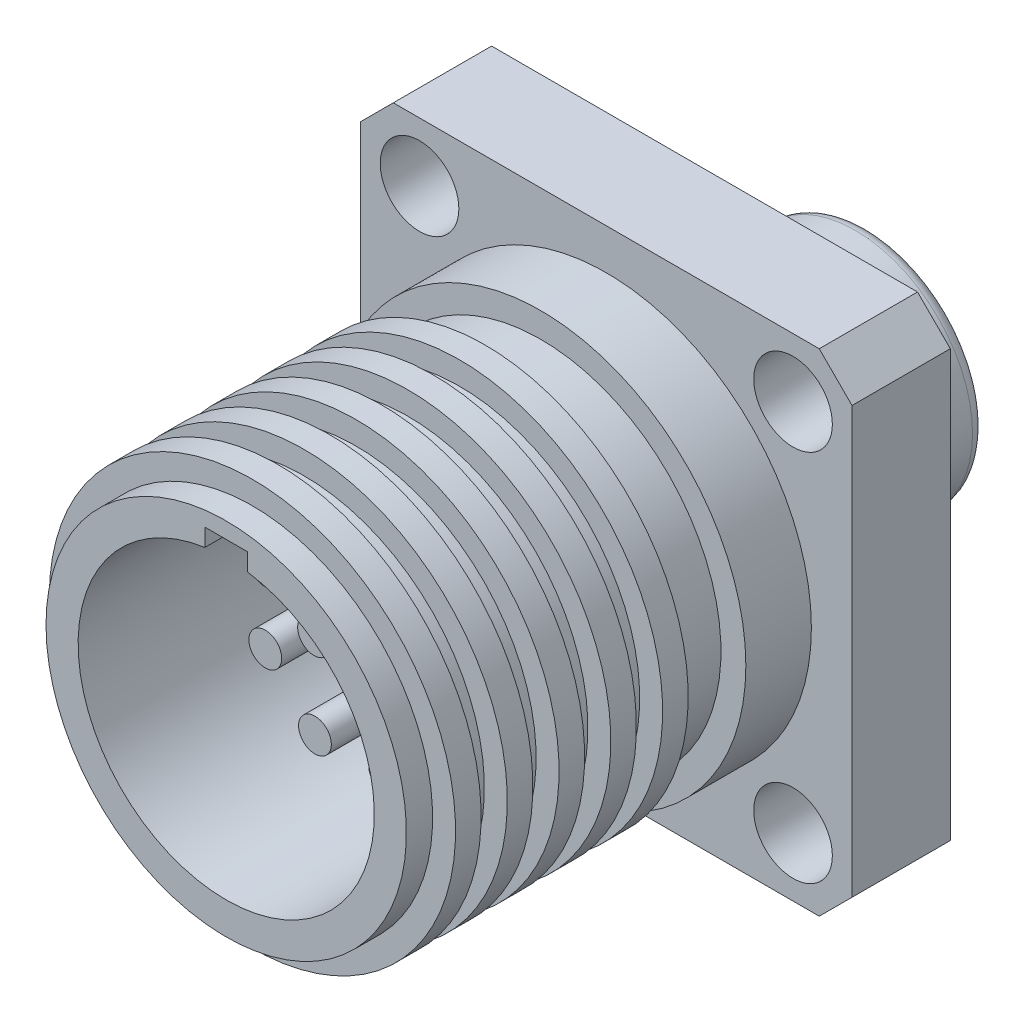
from build123d import *

# Parameters (mm, degrees)
SKETCH1_W           = 19.05
SKETCH1_H           = 19.05
BOSS_EXTRUDE1_DEPTH = 3.81
CHAMFER1_SIZE       = 1.27
SKETCH2_R           = 1.524
CUT_EXTRUDE1_DEPTH  = 14.99883388
CIRPATTERN1_COUNT   = 4
SKETCH3_R           = 7.9502
BOSS_EXTRUDE2_DEPTH = 2.54
SKETCH11_R          = 6.985
BOSS_EXTRUDE6_DEPTH = 12.192
CUT_EXTRUDE2_DEPTH  = 10.0838
SKETCH6_R           = 0.635
BOSS_EXTRUDE4_DEPTH = 5.2832
CIRPATTERN2_COUNT   = 8
SKETCH7_R           = 0.635
BOSS_EXTRUDE5_DEPTH = 5.2832
SKETCH12_W          = 0.889
SKETCH12_H          = 0.9906
SKETCH4_R           = 4.5466
BOSS_EXTRUDE3_DEPTH = 6.35
SKETCH9_W           = 1.3462
SKETCH9_H           = 0.4191
SKETCH10_W          = 0.889
SKETCH10_H          = 1.8288
FILLET1_R           = 0.508


with BuildPart() as part:
    # Sketch1 → Boss-Extrude1 (new body)
    with BuildSketch(Plane.XY):
        Rectangle(SKETCH1_W, SKETCH1_H)
    extrude(amount=BOSS_EXTRUDE1_DEPTH)

    # Chamfer1
    chamfer1_edges = [part.edges().sort_by_distance(p)[0] for p in [
        (-9.525, 9.525, 1.905),
        (9.525, 9.525, 1.905),
        (9.525, -9.525, 1.905),
        (-9.525, -9.525, 1.905),
    ]]
    chamfer(chamfer1_edges, length=CHAMFER1_SIZE)

    # Sketch2 → Cut-Extrude1 (cut, through all)
    with BuildSketch(Plane.XY.offset(3.81)):
        with Locations((-7.239, 7.239)):
            Circle(SKETCH2_R)
    cut_extrude1 = extrude(amount=-CUT_EXTRUDE1_DEPTH, mode=Mode.SUBTRACT)

    # CirPattern1: Cut-Extrude1 ×4 about axis
    cirpattern1_axis = Axis((0, 0, 0), (0, 0, 1))
    for i in range(1, CIRPATTERN1_COUNT):
        add(cut_extrude1.rotate(cirpattern1_axis, i * 360 / CIRPATTERN1_COUNT), mode=Mode.SUBTRACT)

    # Sketch3 → Boss-Extrude2 (add)
    with BuildSketch(Plane.XY.offset(3.81)):
        Circle(SKETCH3_R)
    extrude(amount=BOSS_EXTRUDE2_DEPTH)

    # Sketch11 → Boss-Extrude6 (add)
    with BuildSketch(Plane.XY.offset(6.35)):
        with Locations(Location((0, 0, 0), (0, 0, 180))):
            Circle(SKETCH11_R)
    extrude(amount=BOSS_EXTRUDE6_DEPTH)

    # Sketch5 → Cut-Extrude2 (cut)
    with BuildSketch(Plane.XY.offset(18.542)):
        with BuildLine():
            Line((-0.8255, 6.361686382), (0.8255, 6.361686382))
            Line((0.8255, 6.361686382), (0.8255, 5.680734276))
            ThreePointArc((0.8255, 5.680734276), (0, -5.7404), (-0.8255, 5.680734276))
            Line((-0.8255, 5.680734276), (-0.8255, 6.361686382))
        make_face()
    extrude(amount=-CUT_EXTRUDE2_DEPTH, mode=Mode.SUBTRACT)

    # Sketch6 → Boss-Extrude4 (add)
    with BuildSketch(Plane.XY.offset(8.4582)):
        with Locations((3.285315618, 1.360822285)):
            Circle(SKETCH6_R)
    boss_extrude4 = extrude(amount=BOSS_EXTRUDE4_DEPTH)

    # CirPattern2: Boss-Extrude4 ×8 about axis
    cirpattern2_axis = Axis((0, 0, 0), (0, 0, 1))
    for i in range(1, CIRPATTERN2_COUNT):
        add(boss_extrude4.rotate(cirpattern2_axis, i * 360 / CIRPATTERN2_COUNT))

    # Sketch7 → Boss-Extrude5 (add)
    with BuildSketch(Plane.XY.offset(8.4582)):
        with Locations((1.397, 0)):
            Circle(SKETCH7_R)
        with Locations((-1.397, 0)):
            Circle(SKETCH7_R)
    extrude(amount=BOSS_EXTRUDE5_DEPTH)

    # Sketch12 → Revolve1 (revolve)
    with BuildSketch(Plane(origin=(0, 0, 0), x_dir=(1, 0, 0), z_dir=(0, 1, 0)), mode=Mode.PRIVATE) as revolve1_sk:
        with Locations((7.4295, -17.0307)):
            Rectangle(SKETCH12_W, SKETCH12_H)
        with Locations((7.4295, -15.0241)):
            Rectangle(SKETCH12_W, SKETCH12_H)
        with Locations((7.4295, -13.0175)):
            Rectangle(SKETCH12_W, SKETCH12_H)
        with Locations((7.4295, -11.0109)):
            Rectangle(SKETCH12_W, SKETCH12_H)
        with Locations((7.4295, -9.0043)):
            Rectangle(SKETCH12_W, SKETCH12_H)
    revolve(revolve1_sk.sketch.rotate(Axis((0, 0, 0), (0, 0, 1)), 180), axis=Axis((0, 0, 0), (0, 0, 1)))

    # Sketch4 → Boss-Extrude3 (add)
    with BuildSketch(Plane(origin=(0, 0, 0), x_dir=(-1, 0, 0), z_dir=(0, 0, -1))):
        with Locations(Location((0, 0, 0), (0, 0, 180))):
            Circle(SKETCH4_R)
    extrude(amount=BOSS_EXTRUDE3_DEPTH)

    # Sketch9 → Cut-Revolve 5-698 (revolve, cut)
    with BuildSketch(Plane(origin=(0, 0, 0), x_dir=(0, 0, -1), z_dir=(1, 0, 0)), mode=Mode.PRIVATE) as cut_revolve_5_698_sk:
        with Locations((3.586428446, 4.33705)):
            Rectangle(SKETCH9_W, SKETCH9_H)
    revolve(cut_revolve_5_698_sk.sketch.rotate(Axis((0, 0, -6.35), (0, 0, 1)), 90), axis=Axis((0, 0, -6.35), (0, 0, 1)), mode=Mode.SUBTRACT)

    # Sketch10 → Cut-Revolve 5-058 (revolve, cut)
    with BuildSketch(Plane(origin=(0, 0, 0), x_dir=(0, 0, -1), z_dir=(1, 0, 0)), mode=Mode.PRIVATE) as cut_revolve_5_058_sk:
        with Locations((-0.4445, 6.3246)):
            Rectangle(SKETCH10_W, SKETCH10_H)
    revolve(cut_revolve_5_058_sk.sketch.rotate(Axis((0, 0, 0), (0, 0, -1)), 90), axis=Axis((0, 0, 0), (0, 0, -1)), mode=Mode.SUBTRACT)

    # Fillet1
    fillet1_edges = [part.edges().sort_by_distance(p)[0] for p in [
        (-4.5466, 0, -6.35),
    ]]
    fillet(fillet1_edges, radius=FILLET1_R)


solid = part.part
